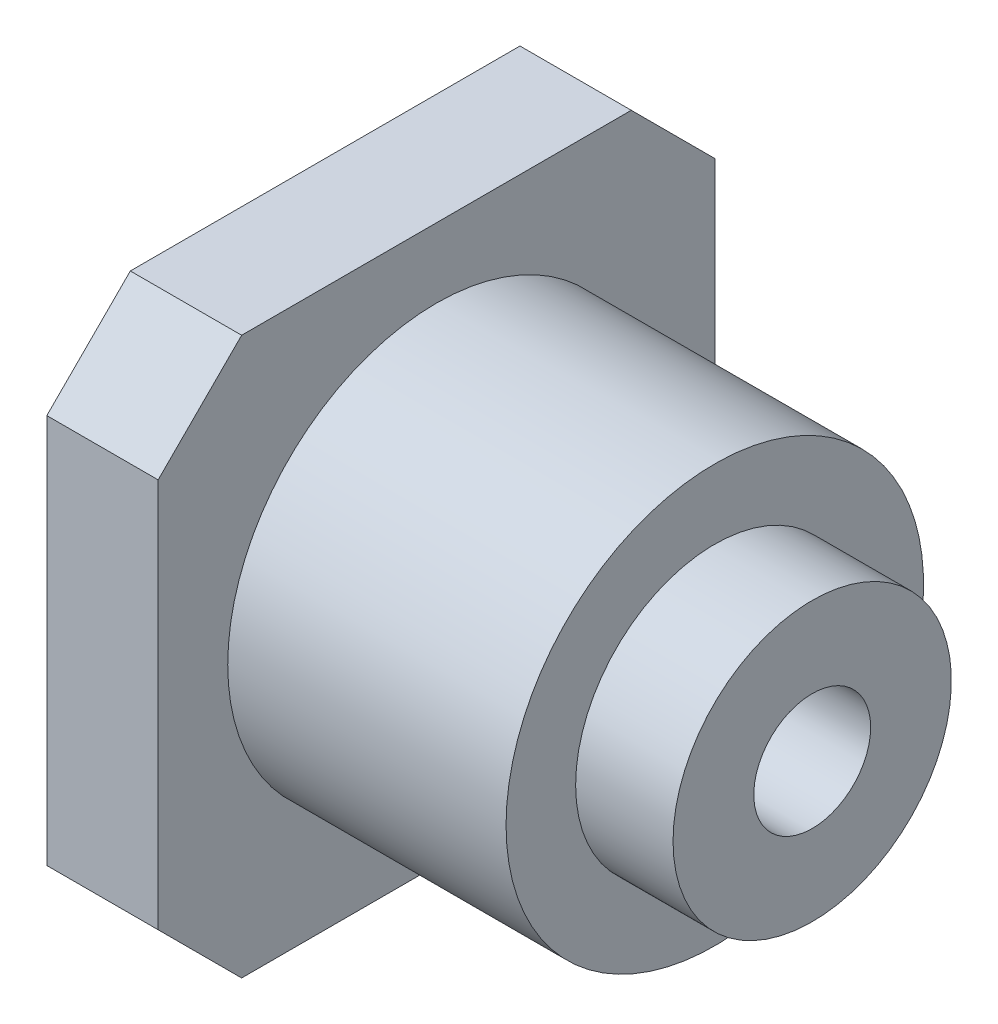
ISO-10303-21;
HEADER;
FILE_DESCRIPTION(('STEP AP214'),'2;1');
FILE_NAME('part.step','',(''),(''),'','','');
FILE_SCHEMA(('AUTOMOTIVE_DESIGN { 1 0 10303 214 1 1 1 1 }'));
ENDSEC;
DATA;
#1=APPLICATION_CONTEXT('core data for automotive mechanical design processes');
#2=APPLICATION_PROTOCOL_DEFINITION('international standard','automotive_design',2000,#1);
#3=PRODUCT_CONTEXT('',#1,'mechanical');
#4=PRODUCT('Part','Part','',(#3));
#5=PRODUCT_RELATED_PRODUCT_CATEGORY('part','',(#4));
#6=PRODUCT_DEFINITION_FORMATION('','',#4);
#7=PRODUCT_DEFINITION_CONTEXT('part definition',#1,'design');
#8=PRODUCT_DEFINITION('design','',#6,#7);
#9=PRODUCT_DEFINITION_SHAPE('','',#8);
#10=(LENGTH_UNIT() NAMED_UNIT(*) SI_UNIT(.MILLI.,.METRE.));
#11=(NAMED_UNIT(*) PLANE_ANGLE_UNIT() SI_UNIT($,.RADIAN.));
#12=(NAMED_UNIT(*) SI_UNIT($,.STERADIAN.) SOLID_ANGLE_UNIT());
#13=UNCERTAINTY_MEASURE_WITH_UNIT(LENGTH_MEASURE(1.E-05),#10,'distance_accuracy_value','');
#14=(GEOMETRIC_REPRESENTATION_CONTEXT(3) GLOBAL_UNCERTAINTY_ASSIGNED_CONTEXT((#13)) GLOBAL_UNIT_ASSIGNED_CONTEXT((#10,
#11,#12)) REPRESENTATION_CONTEXT('',''));
#15=CARTESIAN_POINT('',(0.,0.,0.));
#16=DIRECTION('',(0.,0.,1.));
#17=DIRECTION('',(1.,0.,0.));
#18=AXIS2_PLACEMENT_3D('',#15,#16,#17);
#19=CARTESIAN_POINT('',(17.5,0.,0.));
#20=DIRECTION('',(-1.,0.,0.));
#21=DIRECTION('',(0.,0.,1.));
#22=AXIS2_PLACEMENT_3D('',#19,#20,#21);
#23=PLANE('',#22);
#24=CARTESIAN_POINT('',(17.5,0.,0.));
#25=DIRECTION('',(1.,0.,0.));
#26=DIRECTION('',(0.,0.,-1.));
#27=AXIS2_PLACEMENT_3D('',#24,#25,#26);
#28=CIRCLE('',#27,2.09999999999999);
#29=CARTESIAN_POINT('',(17.5,0.,-2.09999999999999));
#30=VERTEX_POINT('',#29);
#31=EDGE_CURVE('E231',#30,#30,#28,.T.);
#32=ORIENTED_EDGE('',*,*,#31,.F.);
#33=EDGE_LOOP('',(#32));
#34=FACE_BOUND('',#33,.T.);
#35=CARTESIAN_POINT('',(17.5,0.,0.));
#36=DIRECTION('',(-1.,0.,0.));
#37=DIRECTION('',(0.,0.,1.));
#38=AXIS2_PLACEMENT_3D('',#35,#36,#37);
#39=CIRCLE('',#38,5.);
#40=CARTESIAN_POINT('',(17.5,0.,5.));
#41=VERTEX_POINT('',#40);
#42=EDGE_CURVE('E11',#41,#41,#39,.T.);
#43=ORIENTED_EDGE('',*,*,#42,.F.);
#44=EDGE_LOOP('',(#43));
#45=FACE_BOUND('',#44,.T.);
#46=ADVANCED_FACE('F31',(#34,#45),#23,.F.);
#47=CARTESIAN_POINT('',(0.,0.,0.));
#48=DIRECTION('',(-1.,0.,0.));
#49=DIRECTION('',(0.,0.,1.));
#50=AXIS2_PLACEMENT_3D('',#47,#48,#49);
#51=CYLINDRICAL_SURFACE('',#50,5.);
#52=CARTESIAN_POINT('',(14.,0.,0.));
#53=DIRECTION('',(-1.,0.,0.));
#54=DIRECTION('',(0.,0.,1.));
#55=AXIS2_PLACEMENT_3D('',#52,#53,#54);
#56=CIRCLE('',#55,4.99999999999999);
#57=CARTESIAN_POINT('',(14.,0.,4.99999999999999));
#58=VERTEX_POINT('',#57);
#59=EDGE_CURVE('E41',#58,#58,#56,.T.);
#60=ORIENTED_EDGE('',*,*,#59,.F.);
#61=EDGE_LOOP('',(#60));
#62=FACE_BOUND('',#61,.T.);
#63=ORIENTED_EDGE('',*,*,#42,.T.);
#64=EDGE_LOOP('',(#63));
#65=FACE_BOUND('',#64,.T.);
#66=ADVANCED_FACE('F174',(#62,#65),#51,.T.);
#67=CARTESIAN_POINT('',(14.,4.99999999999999,0.));
#68=DIRECTION('',(-1.,0.,0.));
#69=DIRECTION('',(0.,0.,1.));
#70=AXIS2_PLACEMENT_3D('',#67,#68,#69);
#71=PLANE('',#70);
#72=CARTESIAN_POINT('',(14.,0.,0.));
#73=DIRECTION('',(-1.,0.,0.));
#74=DIRECTION('',(0.,0.,1.));
#75=AXIS2_PLACEMENT_3D('',#72,#73,#74);
#76=CIRCLE('',#75,7.5);
#77=CARTESIAN_POINT('',(14.,0.,7.5));
#78=VERTEX_POINT('',#77);
#79=EDGE_CURVE('E166',#78,#78,#76,.T.);
#80=ORIENTED_EDGE('',*,*,#79,.F.);
#81=EDGE_LOOP('',(#80));
#82=FACE_BOUND('',#81,.T.);
#83=ORIENTED_EDGE('',*,*,#59,.T.);
#84=EDGE_LOOP('',(#83));
#85=FACE_BOUND('',#84,.T.);
#86=ADVANCED_FACE('F172',(#82,#85),#71,.F.);
#87=CARTESIAN_POINT('',(0.,0.,0.));
#88=DIRECTION('',(-1.,0.,0.));
#89=DIRECTION('',(0.,0.,1.));
#90=AXIS2_PLACEMENT_3D('',#87,#88,#89);
#91=CYLINDRICAL_SURFACE('',#90,7.5);
#92=CARTESIAN_POINT('',(4.,0.,0.));
#93=DIRECTION('',(1.,0.,0.));
#94=DIRECTION('',(0.,0.,-1.));
#95=AXIS2_PLACEMENT_3D('',#92,#93,#94);
#96=CIRCLE('',#95,7.5);
#97=CARTESIAN_POINT('',(4.,0.,-7.5));
#98=VERTEX_POINT('',#97);
#99=EDGE_CURVE('E35',#98,#98,#96,.T.);
#100=ORIENTED_EDGE('',*,*,#99,.T.);
#101=EDGE_LOOP('',(#100));
#102=FACE_BOUND('',#101,.T.);
#103=ORIENTED_EDGE('',*,*,#79,.T.);
#104=EDGE_LOOP('',(#103));
#105=FACE_BOUND('',#104,.T.);
#106=ADVANCED_FACE('F188',(#102,#105),#91,.T.);
#107=CARTESIAN_POINT('',(4.,10.,10.));
#108=DIRECTION('',(1.,0.,0.));
#109=DIRECTION('',(0.,0.,-1.));
#110=AXIS2_PLACEMENT_3D('',#107,#108,#109);
#111=PLANE('',#110);
#112=DIRECTION('',(0.,0.,-1.));
#113=VECTOR('',#112,1.);
#114=CARTESIAN_POINT('',(4.,10.,-7.));
#115=LINE('',#114,#113);
#116=CARTESIAN_POINT('',(4.,10.,7.));
#117=VERTEX_POINT('',#116);
#118=CARTESIAN_POINT('',(4.,10.,-7.));
#119=VERTEX_POINT('',#118);
#120=EDGE_CURVE('E155',#117,#119,#115,.T.);
#121=ORIENTED_EDGE('',*,*,#120,.F.);
#122=DIRECTION('',(0.,0.707106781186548,-0.707106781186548));
#123=VECTOR('',#122,1.);
#124=CARTESIAN_POINT('',(4.,10.,7.));
#125=LINE('',#124,#123);
#126=CARTESIAN_POINT('',(4.,7.,10.));
#127=VERTEX_POINT('',#126);
#128=EDGE_CURVE('E123',#127,#117,#125,.T.);
#129=ORIENTED_EDGE('',*,*,#128,.F.);
#130=DIRECTION('',(0.,1.,0.));
#131=VECTOR('',#130,1.);
#132=CARTESIAN_POINT('',(4.,7.,10.));
#133=LINE('',#132,#131);
#134=CARTESIAN_POINT('',(4.,-7.,10.));
#135=VERTEX_POINT('',#134);
#136=EDGE_CURVE('E107',#135,#127,#133,.T.);
#137=ORIENTED_EDGE('',*,*,#136,.F.);
#138=DIRECTION('',(0.,0.707106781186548,0.707106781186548));
#139=VECTOR('',#138,1.);
#140=CARTESIAN_POINT('',(4.,-10.,7.));
#141=LINE('',#140,#139);
#142=CARTESIAN_POINT('',(4.,-10.,7.));
#143=VERTEX_POINT('',#142);
#144=EDGE_CURVE('E121',#143,#135,#141,.T.);
#145=ORIENTED_EDGE('',*,*,#144,.F.);
#146=DIRECTION('',(0.,0.,1.));
#147=VECTOR('',#146,1.);
#148=CARTESIAN_POINT('',(4.,-10.,-7.));
#149=LINE('',#148,#147);
#150=CARTESIAN_POINT('',(4.,-10.,-7.));
#151=VERTEX_POINT('',#150);
#152=EDGE_CURVE('E126',#151,#143,#149,.T.);
#153=ORIENTED_EDGE('',*,*,#152,.F.);
#154=DIRECTION('',(0.,-0.707106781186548,0.707106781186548));
#155=VECTOR('',#154,1.);
#156=CARTESIAN_POINT('',(4.,-7.,-10.));
#157=LINE('',#156,#155);
#158=CARTESIAN_POINT('',(4.,-7.,-10.));
#159=VERTEX_POINT('',#158);
#160=EDGE_CURVE('E128',#159,#151,#157,.T.);
#161=ORIENTED_EDGE('',*,*,#160,.F.);
#162=DIRECTION('',(0.,-1.,0.));
#163=VECTOR('',#162,1.);
#164=CARTESIAN_POINT('',(4.,7.,-10.));
#165=LINE('',#164,#163);
#166=CARTESIAN_POINT('',(4.,7.,-10.));
#167=VERTEX_POINT('',#166);
#168=EDGE_CURVE('E238',#167,#159,#165,.T.);
#169=ORIENTED_EDGE('',*,*,#168,.F.);
#170=DIRECTION('',(0.,-0.707106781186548,-0.707106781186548));
#171=VECTOR('',#170,1.);
#172=CARTESIAN_POINT('',(4.,7.,-10.));
#173=LINE('',#172,#171);
#174=EDGE_CURVE('E236',#119,#167,#173,.T.);
#175=ORIENTED_EDGE('',*,*,#174,.F.);
#176=EDGE_LOOP('',(#121,#129,#137,#145,#153,#161,#169,#175));
#177=FACE_BOUND('',#176,.T.);
#178=ORIENTED_EDGE('',*,*,#99,.F.);
#179=EDGE_LOOP('',(#178));
#180=FACE_BOUND('',#179,.T.);
#181=ADVANCED_FACE('F118',(#177,#180),#111,.T.);
#182=CARTESIAN_POINT('',(4.,10.,-7.));
#183=DIRECTION('',(0.,1.,0.));
#184=DIRECTION('',(0.,0.,1.));
#185=AXIS2_PLACEMENT_3D('',#182,#183,#184);
#186=PLANE('',#185);
#187=DIRECTION('',(0.,0.,-1.));
#188=VECTOR('',#187,1.);
#189=CARTESIAN_POINT('',(0.,10.,-7.));
#190=LINE('',#189,#188);
#191=CARTESIAN_POINT('',(0.,10.,7.));
#192=VERTEX_POINT('',#191);
#193=CARTESIAN_POINT('',(0.,10.,-7.));
#194=VERTEX_POINT('',#193);
#195=EDGE_CURVE('E133',#192,#194,#190,.T.);
#196=ORIENTED_EDGE('',*,*,#195,.F.);
#197=DIRECTION('',(-1.,0.,0.));
#198=VECTOR('',#197,1.);
#199=CARTESIAN_POINT('',(4.,10.,7.));
#200=LINE('',#199,#198);
#201=EDGE_CURVE('E49',#117,#192,#200,.T.);
#202=ORIENTED_EDGE('',*,*,#201,.F.);
#203=ORIENTED_EDGE('',*,*,#120,.T.);
#204=DIRECTION('',(-1.,0.,0.));
#205=VECTOR('',#204,1.);
#206=CARTESIAN_POINT('',(4.,10.,-7.));
#207=LINE('',#206,#205);
#208=EDGE_CURVE('E90',#119,#194,#207,.T.);
#209=ORIENTED_EDGE('',*,*,#208,.T.);
#210=EDGE_LOOP('',(#196,#202,#203,#209));
#211=FACE_BOUND('',#210,.T.);
#212=ADVANCED_FACE('F193',(#211),#186,.T.);
#213=CARTESIAN_POINT('',(4.,10.,7.));
#214=DIRECTION('',(0.,0.707106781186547,0.707106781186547));
#215=DIRECTION('',(0.,-0.707106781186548,0.707106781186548));
#216=AXIS2_PLACEMENT_3D('',#213,#214,#215);
#217=PLANE('',#216);
#218=DIRECTION('',(0.,0.707106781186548,-0.707106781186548));
#219=VECTOR('',#218,1.);
#220=CARTESIAN_POINT('',(0.,10.,7.));
#221=LINE('',#220,#219);
#222=CARTESIAN_POINT('',(0.,7.,10.));
#223=VERTEX_POINT('',#222);
#224=EDGE_CURVE('E152',#223,#192,#221,.T.);
#225=ORIENTED_EDGE('',*,*,#224,.F.);
#226=DIRECTION('',(-1.,0.,0.));
#227=VECTOR('',#226,1.);
#228=CARTESIAN_POINT('',(4.,7.,10.));
#229=LINE('',#228,#227);
#230=EDGE_CURVE('E78',#127,#223,#229,.T.);
#231=ORIENTED_EDGE('',*,*,#230,.F.);
#232=ORIENTED_EDGE('',*,*,#128,.T.);
#233=ORIENTED_EDGE('',*,*,#201,.T.);
#234=EDGE_LOOP('',(#225,#231,#232,#233));
#235=FACE_BOUND('',#234,.T.);
#236=ADVANCED_FACE('F196',(#235),#217,.T.);
#237=CARTESIAN_POINT('',(4.,7.,10.));
#238=DIRECTION('',(0.,0.,1.));
#239=DIRECTION('',(0.,-1.,0.));
#240=AXIS2_PLACEMENT_3D('',#237,#238,#239);
#241=PLANE('',#240);
#242=DIRECTION('',(0.,1.,0.));
#243=VECTOR('',#242,1.);
#244=CARTESIAN_POINT('',(0.,7.,10.));
#245=LINE('',#244,#243);
#246=CARTESIAN_POINT('',(0.,-7.,10.));
#247=VERTEX_POINT('',#246);
#248=EDGE_CURVE('E109',#247,#223,#245,.T.);
#249=ORIENTED_EDGE('',*,*,#248,.F.);
#250=DIRECTION('',(-1.,0.,0.));
#251=VECTOR('',#250,1.);
#252=CARTESIAN_POINT('',(4.,-7.,10.));
#253=LINE('',#252,#251);
#254=EDGE_CURVE('E104',#135,#247,#253,.T.);
#255=ORIENTED_EDGE('',*,*,#254,.F.);
#256=ORIENTED_EDGE('',*,*,#136,.T.);
#257=ORIENTED_EDGE('',*,*,#230,.T.);
#258=EDGE_LOOP('',(#249,#255,#256,#257));
#259=FACE_BOUND('',#258,.T.);
#260=ADVANCED_FACE('F106',(#259),#241,.T.);
#261=CARTESIAN_POINT('',(4.,-10.,7.));
#262=DIRECTION('',(0.,-0.707106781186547,0.707106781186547));
#263=DIRECTION('',(0.,-0.707106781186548,-0.707106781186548));
#264=AXIS2_PLACEMENT_3D('',#261,#262,#263);
#265=PLANE('',#264);
#266=DIRECTION('',(0.,0.707106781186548,0.707106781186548));
#267=VECTOR('',#266,1.);
#268=CARTESIAN_POINT('',(0.,-10.,7.));
#269=LINE('',#268,#267);
#270=CARTESIAN_POINT('',(0.,-10.,7.));
#271=VERTEX_POINT('',#270);
#272=EDGE_CURVE('E149',#271,#247,#269,.T.);
#273=ORIENTED_EDGE('',*,*,#272,.F.);
#274=DIRECTION('',(-1.,0.,0.));
#275=VECTOR('',#274,1.);
#276=CARTESIAN_POINT('',(4.,-10.,7.));
#277=LINE('',#276,#275);
#278=EDGE_CURVE('E114',#143,#271,#277,.T.);
#279=ORIENTED_EDGE('',*,*,#278,.F.);
#280=ORIENTED_EDGE('',*,*,#144,.T.);
#281=ORIENTED_EDGE('',*,*,#254,.T.);
#282=EDGE_LOOP('',(#273,#279,#280,#281));
#283=FACE_BOUND('',#282,.T.);
#284=ADVANCED_FACE('F125',(#283),#265,.T.);
#285=CARTESIAN_POINT('',(4.,-10.,-7.));
#286=DIRECTION('',(0.,-1.,0.));
#287=DIRECTION('',(0.,0.,-1.));
#288=AXIS2_PLACEMENT_3D('',#285,#286,#287);
#289=PLANE('',#288);
#290=DIRECTION('',(0.,0.,1.));
#291=VECTOR('',#290,1.);
#292=CARTESIAN_POINT('',(0.,-10.,-7.));
#293=LINE('',#292,#291);
#294=CARTESIAN_POINT('',(0.,-10.,-7.));
#295=VERTEX_POINT('',#294);
#296=EDGE_CURVE('E146',#295,#271,#293,.T.);
#297=ORIENTED_EDGE('',*,*,#296,.F.);
#298=DIRECTION('',(-1.,0.,0.));
#299=VECTOR('',#298,1.);
#300=CARTESIAN_POINT('',(4.,-10.,-7.));
#301=LINE('',#300,#299);
#302=EDGE_CURVE('E159',#151,#295,#301,.T.);
#303=ORIENTED_EDGE('',*,*,#302,.F.);
#304=ORIENTED_EDGE('',*,*,#152,.T.);
#305=ORIENTED_EDGE('',*,*,#278,.T.);
#306=EDGE_LOOP('',(#297,#303,#304,#305));
#307=FACE_BOUND('',#306,.T.);
#308=ADVANCED_FACE('F207',(#307),#289,.T.);
#309=CARTESIAN_POINT('',(4.,-7.,-10.));
#310=DIRECTION('',(0.,-0.707106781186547,-0.707106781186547));
#311=DIRECTION('',(0.,0.707106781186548,-0.707106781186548));
#312=AXIS2_PLACEMENT_3D('',#309,#310,#311);
#313=PLANE('',#312);
#314=DIRECTION('',(0.,-0.707106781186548,0.707106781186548));
#315=VECTOR('',#314,1.);
#316=CARTESIAN_POINT('',(0.,-7.,-10.));
#317=LINE('',#316,#315);
#318=CARTESIAN_POINT('',(0.,-7.,-10.));
#319=VERTEX_POINT('',#318);
#320=EDGE_CURVE('E143',#319,#295,#317,.T.);
#321=ORIENTED_EDGE('',*,*,#320,.F.);
#322=DIRECTION('',(-1.,0.,0.));
#323=VECTOR('',#322,1.);
#324=CARTESIAN_POINT('',(4.,-7.,-10.));
#325=LINE('',#324,#323);
#326=EDGE_CURVE('E161',#159,#319,#325,.T.);
#327=ORIENTED_EDGE('',*,*,#326,.F.);
#328=ORIENTED_EDGE('',*,*,#160,.T.);
#329=ORIENTED_EDGE('',*,*,#302,.T.);
#330=EDGE_LOOP('',(#321,#327,#328,#329));
#331=FACE_BOUND('',#330,.T.);
#332=ADVANCED_FACE('F203',(#331),#313,.T.);
#333=CARTESIAN_POINT('',(4.,7.,-10.));
#334=DIRECTION('',(0.,0.,-1.));
#335=DIRECTION('',(0.,1.,0.));
#336=AXIS2_PLACEMENT_3D('',#333,#334,#335);
#337=PLANE('',#336);
#338=DIRECTION('',(0.,-1.,0.));
#339=VECTOR('',#338,1.);
#340=CARTESIAN_POINT('',(0.,7.,-10.));
#341=LINE('',#340,#339);
#342=CARTESIAN_POINT('',(0.,7.,-10.));
#343=VERTEX_POINT('',#342);
#344=EDGE_CURVE('E140',#343,#319,#341,.T.);
#345=ORIENTED_EDGE('',*,*,#344,.F.);
#346=DIRECTION('',(-1.,0.,0.));
#347=VECTOR('',#346,1.);
#348=CARTESIAN_POINT('',(4.,7.,-10.));
#349=LINE('',#348,#347);
#350=EDGE_CURVE('E163',#167,#343,#349,.T.);
#351=ORIENTED_EDGE('',*,*,#350,.F.);
#352=ORIENTED_EDGE('',*,*,#168,.T.);
#353=ORIENTED_EDGE('',*,*,#326,.T.);
#354=EDGE_LOOP('',(#345,#351,#352,#353));
#355=FACE_BOUND('',#354,.T.);
#356=ADVANCED_FACE('F200',(#355),#337,.T.);
#357=CARTESIAN_POINT('',(4.,7.,-10.));
#358=DIRECTION('',(0.,0.707106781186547,-0.707106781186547));
#359=DIRECTION('',(0.,0.707106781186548,0.707106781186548));
#360=AXIS2_PLACEMENT_3D('',#357,#358,#359);
#361=PLANE('',#360);
#362=DIRECTION('',(0.,-0.707106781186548,-0.707106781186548));
#363=VECTOR('',#362,1.);
#364=CARTESIAN_POINT('',(0.,7.,-10.));
#365=LINE('',#364,#363);
#366=EDGE_CURVE('E136',#194,#343,#365,.T.);
#367=ORIENTED_EDGE('',*,*,#366,.F.);
#368=ORIENTED_EDGE('',*,*,#208,.F.);
#369=ORIENTED_EDGE('',*,*,#174,.T.);
#370=ORIENTED_EDGE('',*,*,#350,.T.);
#371=EDGE_LOOP('',(#367,#368,#369,#370));
#372=FACE_BOUND('',#371,.T.);
#373=ADVANCED_FACE('F197',(#372),#361,.T.);
#374=CARTESIAN_POINT('',(0.,7.5,0.));
#375=DIRECTION('',(1.,0.,0.));
#376=DIRECTION('',(0.,0.,-1.));
#377=AXIS2_PLACEMENT_3D('',#374,#375,#376);
#378=PLANE('',#377);
#379=CARTESIAN_POINT('',(0.,0.,0.));
#380=DIRECTION('',(1.,0.,0.));
#381=DIRECTION('',(0.,0.,-1.));
#382=AXIS2_PLACEMENT_3D('',#379,#380,#381);
#383=CIRCLE('',#382,2.1);
#384=CARTESIAN_POINT('',(0.,0.,-2.1));
#385=VERTEX_POINT('',#384);
#386=EDGE_CURVE('E137',#385,#385,#383,.T.);
#387=ORIENTED_EDGE('',*,*,#386,.T.);
#388=EDGE_LOOP('',(#387));
#389=FACE_BOUND('',#388,.T.);
#390=ORIENTED_EDGE('',*,*,#195,.T.);
#391=ORIENTED_EDGE('',*,*,#366,.T.);
#392=ORIENTED_EDGE('',*,*,#344,.T.);
#393=ORIENTED_EDGE('',*,*,#320,.T.);
#394=ORIENTED_EDGE('',*,*,#296,.T.);
#395=ORIENTED_EDGE('',*,*,#272,.T.);
#396=ORIENTED_EDGE('',*,*,#248,.T.);
#397=ORIENTED_EDGE('',*,*,#224,.T.);
#398=EDGE_LOOP('',(#390,#391,#392,#393,#394,#395,#396,#397));
#399=FACE_BOUND('',#398,.T.);
#400=ADVANCED_FACE('F33',(#389,#399),#378,.F.);
#401=CARTESIAN_POINT('',(17.5,0.,0.));
#402=DIRECTION('',(1.,0.,0.));
#403=DIRECTION('',(0.,0.,-1.));
#404=AXIS2_PLACEMENT_3D('',#401,#402,#403);
#405=CYLINDRICAL_SURFACE('',#404,2.09999999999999);
#406=ORIENTED_EDGE('',*,*,#386,.F.);
#407=EDGE_LOOP('',(#406));
#408=FACE_BOUND('',#407,.T.);
#409=ORIENTED_EDGE('',*,*,#31,.T.);
#410=EDGE_LOOP('',(#409));
#411=FACE_BOUND('',#410,.T.);
#412=ADVANCED_FACE('F220',(#408,#411),#405,.F.);
#413=CLOSED_SHELL('',(#46,#66,#86,#106,#181,#212,#236,#260,#284,#308,#332,#356,#373,#400,#412));
#414=MANIFOLD_SOLID_BREP('B2',#413);
#415=ADVANCED_BREP_SHAPE_REPRESENTATION('',(#18,#414),#14);
#416=SHAPE_DEFINITION_REPRESENTATION(#9,#415);
ENDSEC;
END-ISO-10303-21;
